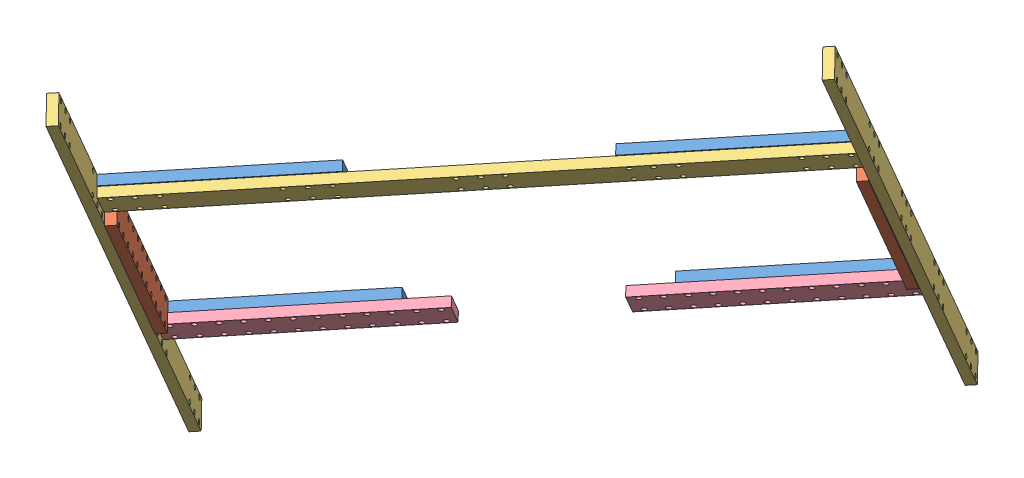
SolidWorks assembly 装甲.SLDASM, configuration 默认 (file format 10000). Lengths in mm.
Overall size (522.41 504.92 571.7).
11 component instances, 4 part files, 29 mates.
Components (placement in the parent):
- 10孔-1: 10孔.SLDPRT [默认] at (-152.4171 134.3938 1073.2734) x (0.772418 0.148459 -0.61752) z (0.230012 0.840905 0.489871) size (159 8 24)
- 11孔-1: 11孔.SLDPRT [默认] at (-205.1946 -12.1528 999.1186) x (0.230012 0.840905 0.489871) z (0.592001 -0.520422 0.615382) size (175 8 24)
- 最长的零件-1: 最长的零件.SLDPRT [默认] at (-150.5515 131.8575 1082.3338) x (0.772418 0.148459 -0.61752) z (0.230012 0.840905 0.489871) size (495 8 23)
- 最长的零件-4: 最长的零件.SLDPRT [默认] at (-243.8094 -149.4043 930.7758) x (0.230012 0.840905 0.489871) z (0.592001 -0.520422 0.615382) size (495 8 23)
- 最长的零件-5: 最长的零件.SLDPRT [默认] at (243.3307 307.1992 848.2889) x (-0.230012 -0.840905 -0.489871) z (0.592001 -0.520422 0.615382) size (495 8 23)
- 10孔-2: 10孔.SLDPRT [默认] at (107.1152 184.2761 865.7867) x (0.772418 0.148459 -0.61752) z (0.230012 0.840905 0.489871) size (159 8 24)
- 11孔-2: 11孔.SLDPRT [默认] at (170.2538 54.159 709.0026) x (0.230012 0.840905 0.489871) z (-0.592001 0.520422 -0.615382) size (175 8 24)
- 10孔-4: 10孔.SLDPRT [默认] at (-199.9166 -39.2604 972.1107) x (0.772418 0.148459 -0.61752) z (0.230012 0.840905 0.489871) size (159 8 24)
- 12孔-2: 12孔.SLDPRT [默认] at (-196.8744 -44.2224 977.9879) x (0.772418 0.148459 -0.61752) z (0.230012 0.840905 0.489871) size (191 8 24)
- 10孔-5: 10孔.SLDPRT [默认] at (59.6158 10.622 764.624) x (0.772418 0.148459 -0.61752) z (0.230012 0.840905 0.489871) size (159 8 24)
- 12孔-3: 12孔.SLDPRT [默认] at (37.9405 0.9093 790.2618) x (0.772418 0.148459 -0.61752) z (0.230012 0.840905 0.489871) size (191 8 24)
Mates (geometry in assembly coordinates):
- 重合9: coincident aligned: circle of 10孔-1; circle of 最长的零件-1
- 重合12: coincident aligned: circle of 最长的零件-1; circle of 10孔-2
- 重合14: coincident anti-aligned: line of 10孔-1 through (-178.8235 125.4968 1078.1523) axis (0.230012 0.840905 0.489871); line of 最长的零件-4 through (-142.8286 257.0911 1154.813) axis (-0.230012 -0.840905 -0.489871)
- 重合15: coincident anti-aligned: plane of 10孔-1 through (-178.8235 125.4968 1078.1523) normal (-0.772418 -0.148459 0.61752); plane of 最长的零件-4 through (-243.8094 -149.4043 930.7758) normal (0.772418 0.148459 -0.61752)
- 平行1: parallel anti-aligned: plane of 最长的零件-4 through (-249.9888 -150.592 935.716) normal (-0.772418 -0.148459 0.61752); plane of 最长的零件-5 through (249.51 308.3868 843.3487) normal (0.772418 0.148459 -0.61752)
- 平行2: parallel anti-aligned: line of 最长的零件-4 through (-149.008 255.9034 1159.7531) axis (-0.230012 -0.840905 -0.489871); line of 最长的零件-5 through (125.8923 -84.8285 607.1442) axis (0.230012 0.840905 0.489871)
- 重合18: coincident: line of 最长的零件-5 through (125.8923 -84.8285 607.1442) axis (0.230012 0.840905 0.489871); moEndPointRef_w of 10孔-2
- 同心4: concentric aligned: circle of 最长的零件-1; circle of 10孔-2
- 同心8: concentric aligned: circle of 10孔-1; circle of 最长的零件-1
- 同心9: concentric anti-aligned: circle of 最长的零件-4; circle of 最长的零件-5
- 重合28: coincident aligned: circle of 11孔-1; circle of 最长的零件-4
- 同心10: concentric aligned: circle of 11孔-1; circle of 最长的零件-4
- 锁定2: lock: unknown of 10孔-1; unknown of 最长的零件-4
- 重合31: coincident aligned: circle of 最长的零件-5; circle of 11孔-2
- 同心13: concentric aligned: circle of 最长的零件-5; circle of 11孔-2
- 同心15: concentric aligned: circle of 10孔-4; circle of 12孔-2
- 同心16: concentric aligned: circle of 10孔-4; circle of 12孔-2
- 重合36: coincident anti-aligned: plane of 10孔-4 through (-199.9166 -39.2604 972.1107) normal (0.592001 -0.520422 0.615382); plane of 12孔-2 through (-201.6105 -40.059 973.0648) normal (-0.592001 0.520422 -0.615382)
- 重合37: coincident anti-aligned: line of 最长的零件-4 through (-142.8286 257.0911 1154.813) axis (-0.230012 -0.840905 -0.489871); line of 10孔-4 through (-226.3229 -48.1573 976.9896) axis (0.230012 0.840905 0.489871)
- 平行5: parallel anti-aligned: plane of 10孔-4 through (-204.6526 -35.097 967.1876) normal (-0.592001 0.520422 -0.615382); plane of 10孔-5 through (59.6158 10.622 764.624) normal (0.592001 -0.520422 0.615382)
- 平行6: parallel anti-aligned: plane of 10孔-5 through (54.8798 14.7853 759.701) normal (-0.592001 0.520422 -0.615382); plane of 12孔-3 through (37.9405 0.9093 790.2618) normal (0.592001 -0.520422 0.615382)
- 同心20: concentric aligned: circle of 10孔-5; circle of 12孔-3
- 同心21: concentric aligned: circle of 10孔-5; circle of 12孔-3
- 重合45: coincident anti-aligned: plane of 10孔-5 through (59.6158 10.622 764.624) normal (0.592001 -0.520422 0.615382); plane of 12孔-3 through (33.2045 5.0726 785.3388) normal (-0.592001 0.520422 -0.615382)
- 平行7: parallel anti-aligned: line of 10孔-4 through (-97.9882 -4.3706 890.5609) axis (-0.230012 -0.840905 -0.489871); line of 10孔-5 through (33.2094 1.725 769.503) axis (0.230012 0.840905 0.489871)
- 重合47: coincident anti-aligned: line of 最长的零件-5 through (125.8923 -84.8285 607.1442) axis (0.230012 0.840905 0.489871); line of 10孔-5 through (161.5441 45.5117 683.0742) axis (-0.230012 -0.840905 -0.489871)
- 重合48: coincident anti-aligned: plane of 最长的零件-5 through (243.3307 307.1992 848.2889) normal (-0.772418 -0.148459 0.61752); plane of 12孔-3 through (160.7598 21.1666 676.2404) normal (0.772418 0.148459 -0.61752)
- 距离3: distance = 4 mm anti-aligned: plane of 11孔-1 through (-219.8826 -24.612 990.706) normal (-0.230012 -0.840905 -0.489871); plane of 10孔-4 through (-220.8027 -27.9756 988.7466) normal (0.230012 0.840905 0.489871)
- 距离4: distance = 4 mm anti-aligned: plane of 11孔-2 through (176.6722 36.3852 699.8029) normal (-0.230012 -0.840905 -0.489871); plane of 10孔-5 through (38.7297 21.9067 781.2599) normal (0.230012 0.840905 0.489871)
